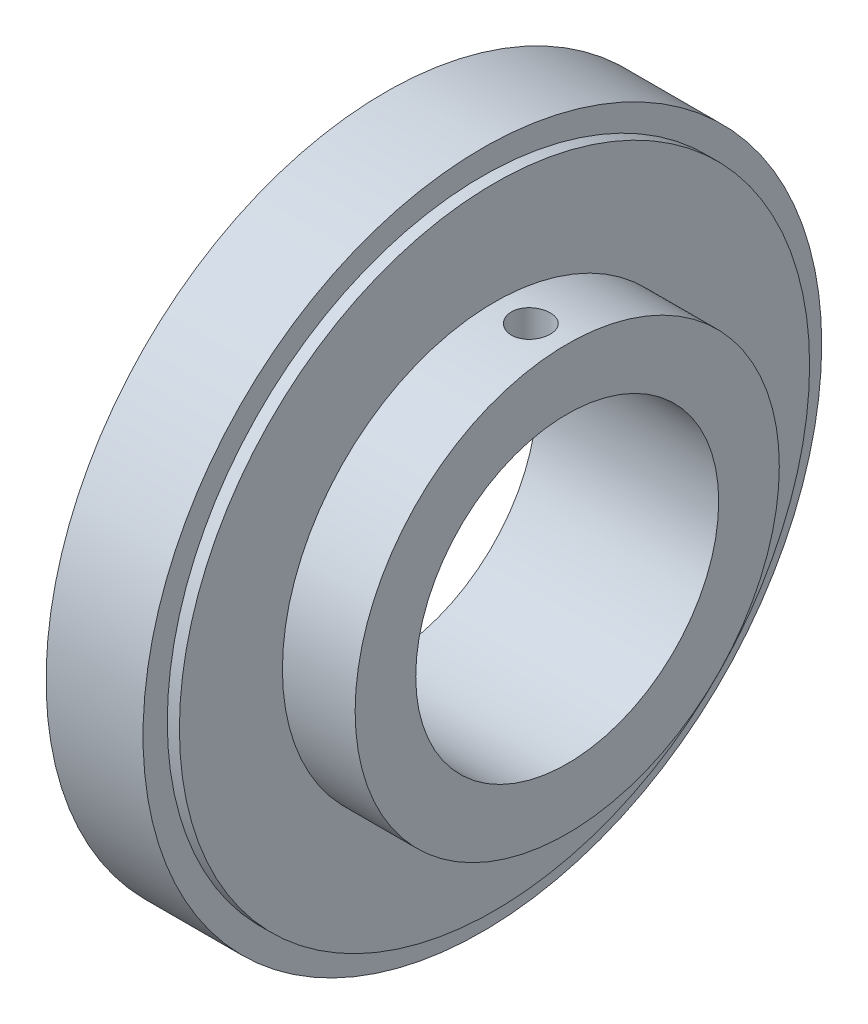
ISO-10303-21;
HEADER;
FILE_DESCRIPTION(('STEP AP214'),'2;1');
FILE_NAME('part.step','',(''),(''),'','','');
FILE_SCHEMA(('AUTOMOTIVE_DESIGN { 1 0 10303 214 1 1 1 1 }'));
ENDSEC;
DATA;
#1=APPLICATION_CONTEXT('core data for automotive mechanical design processes');
#2=APPLICATION_PROTOCOL_DEFINITION('international standard','automotive_design',2000,#1);
#3=PRODUCT_CONTEXT('',#1,'mechanical');
#4=PRODUCT('Part','Part','',(#3));
#5=PRODUCT_RELATED_PRODUCT_CATEGORY('part','',(#4));
#6=PRODUCT_DEFINITION_FORMATION('','',#4);
#7=PRODUCT_DEFINITION_CONTEXT('part definition',#1,'design');
#8=PRODUCT_DEFINITION('design','',#6,#7);
#9=PRODUCT_DEFINITION_SHAPE('','',#8);
#10=(LENGTH_UNIT() NAMED_UNIT(*) SI_UNIT(.MILLI.,.METRE.));
#11=(NAMED_UNIT(*) PLANE_ANGLE_UNIT() SI_UNIT($,.RADIAN.));
#12=(NAMED_UNIT(*) SI_UNIT($,.STERADIAN.) SOLID_ANGLE_UNIT());
#13=UNCERTAINTY_MEASURE_WITH_UNIT(LENGTH_MEASURE(1.E-05),#10,'distance_accuracy_value','');
#14=(GEOMETRIC_REPRESENTATION_CONTEXT(3) GLOBAL_UNCERTAINTY_ASSIGNED_CONTEXT((#13)) GLOBAL_UNIT_ASSIGNED_CONTEXT((#10,
#11,#12)) REPRESENTATION_CONTEXT('',''));
#15=CARTESIAN_POINT('',(0.,0.,0.));
#16=DIRECTION('',(0.,0.,1.));
#17=DIRECTION('',(1.,0.,0.));
#18=AXIS2_PLACEMENT_3D('',#15,#16,#17);
#19=CARTESIAN_POINT('',(-7.00000000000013,28.0000000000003,-3.05311331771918E-13));
#20=DIRECTION('',(1.,0.,0.));
#21=DIRECTION('',(0.,0.,-1.00000000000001));
#22=AXIS2_PLACEMENT_3D('',#19,#20,#21);
#23=PLANE('',#22);
#24=CARTESIAN_POINT('',(-6.99999999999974,0.,0.));
#25=DIRECTION('',(1.,0.,0.));
#26=DIRECTION('',(0.,0.,-1.00000000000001));
#27=AXIS2_PLACEMENT_3D('',#24,#25,#26);
#28=CIRCLE('',#27,28.);
#29=CARTESIAN_POINT('',(-6.99999999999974,0.,-28.0000000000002));
#30=VERTEX_POINT('',#29);
#31=EDGE_CURVE('E54',#30,#30,#28,.T.);
#32=ORIENTED_EDGE('',*,*,#31,.T.);
#33=EDGE_LOOP('',(#32));
#34=FACE_BOUND('',#33,.T.);
#35=CARTESIAN_POINT('',(-6.99999999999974,0.,0.));
#36=DIRECTION('',(1.,0.,0.));
#37=DIRECTION('',(0.,0.,-1.00000000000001));
#38=AXIS2_PLACEMENT_3D('',#35,#36,#37);
#39=CIRCLE('',#38,17.5);
#40=CARTESIAN_POINT('',(-6.99999999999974,0.,-17.5000000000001));
#41=VERTEX_POINT('',#40);
#42=EDGE_CURVE('E11',#41,#41,#39,.T.);
#43=ORIENTED_EDGE('',*,*,#42,.F.);
#44=EDGE_LOOP('',(#43));
#45=FACE_BOUND('',#44,.T.);
#46=ADVANCED_FACE('F40',(#34,#45),#23,.T.);
#47=CARTESIAN_POINT('',(-1.52655665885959E-13,0.,0.));
#48=DIRECTION('',(1.,0.,0.));
#49=DIRECTION('',(0.,0.,-1.00000000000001));
#50=AXIS2_PLACEMENT_3D('',#47,#48,#49);
#51=CYLINDRICAL_SURFACE('',#50,17.5);
#52=ORIENTED_EDGE('',*,*,#42,.T.);
#53=EDGE_LOOP('',(#52));
#54=FACE_BOUND('',#53,.T.);
#55=CARTESIAN_POINT('',(-15.,0.,0.));
#56=DIRECTION('',(1.,0.,0.));
#57=DIRECTION('',(0.,0.,-1.00000000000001));
#58=AXIS2_PLACEMENT_3D('',#55,#56,#57);
#59=CIRCLE('',#58,17.5);
#60=CARTESIAN_POINT('',(-15.,0.,-17.5000000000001));
#61=VERTEX_POINT('',#60);
#62=EDGE_CURVE('E46',#61,#61,#59,.T.);
#63=ORIENTED_EDGE('',*,*,#62,.F.);
#64=EDGE_LOOP('',(#63));
#65=FACE_BOUND('',#64,.T.);
#66=ADVANCED_FACE('F70',(#54,#65),#51,.F.);
#67=CARTESIAN_POINT('',(-15.0000000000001,17.5,0.));
#68=DIRECTION('',(-1.,0.,0.));
#69=DIRECTION('',(0.,0.,1.00000000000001));
#70=AXIS2_PLACEMENT_3D('',#67,#68,#69);
#71=PLANE('',#70);
#72=ORIENTED_EDGE('',*,*,#62,.T.);
#73=EDGE_LOOP('',(#72));
#74=FACE_BOUND('',#73,.T.);
#75=CARTESIAN_POINT('',(-15.,0.,0.));
#76=DIRECTION('',(1.,0.,0.));
#77=DIRECTION('',(0.,0.,-1.00000000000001));
#78=AXIS2_PLACEMENT_3D('',#75,#76,#77);
#79=CIRCLE('',#78,28.);
#80=CARTESIAN_POINT('',(-15.,0.,-28.0000000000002));
#81=VERTEX_POINT('',#80);
#82=EDGE_CURVE('E50',#81,#81,#79,.T.);
#83=ORIENTED_EDGE('',*,*,#82,.F.);
#84=EDGE_LOOP('',(#83));
#85=FACE_BOUND('',#84,.T.);
#86=ADVANCED_FACE('F64',(#74,#85),#71,.T.);
#87=CARTESIAN_POINT('',(-1.52655665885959E-13,0.,0.));
#88=DIRECTION('',(1.,0.,0.));
#89=DIRECTION('',(0.,0.,-1.00000000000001));
#90=AXIS2_PLACEMENT_3D('',#87,#88,#89);
#91=CYLINDRICAL_SURFACE('',#90,28.);
#92=ORIENTED_EDGE('',*,*,#82,.T.);
#93=EDGE_LOOP('',(#92));
#94=FACE_BOUND('',#93,.T.);
#95=ORIENTED_EDGE('',*,*,#31,.F.);
#96=EDGE_LOOP('',(#95));
#97=FACE_BOUND('',#96,.T.);
#98=ADVANCED_FACE('F62',(#94,#97),#91,.T.);
#99=CLOSED_SHELL('',(#46,#66,#86,#98));
#100=MANIFOLD_SOLID_BREP('B2',#99);
#101=CARTESIAN_POINT('',(-1.52655665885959E-13,0.,0.));
#102=DIRECTION('',(1.,0.,0.));
#103=DIRECTION('',(0.,0.,-1.00000000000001));
#104=AXIS2_PLACEMENT_3D('',#101,#102,#103);
#105=CYLINDRICAL_SURFACE('',#104,12.5);
#106=CARTESIAN_POINT('',(-4.59999999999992,12.4999999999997,1.66533453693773E-13));
#107=CARTESIAN_POINT('',(-4.59999620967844,12.4999987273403,-0.0894802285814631));
#108=CARTESIAN_POINT('',(-4.59246839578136,12.4990290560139,-0.179015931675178));
#109=CARTESIAN_POINT('',(-4.56255800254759,12.4952541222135,-0.355594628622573));
#110=CARTESIAN_POINT('',(-4.54016002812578,12.4924469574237,-0.442634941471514));
#111=CARTESIAN_POINT('',(-4.4811810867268,12.4853131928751,-0.61164105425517));
#112=CARTESIAN_POINT('',(-4.44460979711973,12.4809876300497,-0.693610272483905));
#113=CARTESIAN_POINT('',(-4.3583438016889,12.4712978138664,-0.850232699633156));
#114=CARTESIAN_POINT('',(-4.30865129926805,12.4659337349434,-0.924887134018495));
#115=CARTESIAN_POINT('',(-4.19724751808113,12.4547309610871,-1.0652061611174));
#116=CARTESIAN_POINT('',(-4.13547572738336,12.4488899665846,-1.1308225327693));
#117=CARTESIAN_POINT('',(-4.00179681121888,12.4374101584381,-1.25078744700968));
#118=CARTESIAN_POINT('',(-3.92988916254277,12.4317713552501,-1.3051354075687));
#119=CARTESIAN_POINT('',(-3.77766511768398,12.421311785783,-1.40120131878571));
#120=CARTESIAN_POINT('',(-3.69731988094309,12.4164939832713,-1.4428739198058));
#121=CARTESIAN_POINT('',(-3.53069940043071,12.4082523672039,-1.51211654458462));
#122=CARTESIAN_POINT('',(-3.44442439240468,12.4048284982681,-1.53968712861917));
#123=CARTESIAN_POINT('',(-3.26889469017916,12.3997844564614,-1.57979618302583));
#124=CARTESIAN_POINT('',(-3.17965891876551,12.3981545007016,-1.59241621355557));
#125=CARTESIAN_POINT('',(-3.00032233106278,12.3968529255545,-1.60251833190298));
#126=CARTESIAN_POINT('',(-2.91022155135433,12.3971812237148,-1.60000105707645));
#127=CARTESIAN_POINT('',(-2.73228183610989,12.3997501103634,-1.57996693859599));
#128=CARTESIAN_POINT('',(-2.64443258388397,12.4019792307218,-1.5625400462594));
#129=CARTESIAN_POINT('',(-2.47291569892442,12.4080807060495,-1.51332177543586));
#130=CARTESIAN_POINT('',(-2.38924815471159,12.411953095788,-1.48153009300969));
#131=CARTESIAN_POINT('',(-2.22819089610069,12.4209177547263,-1.40438835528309));
#132=CARTESIAN_POINT('',(-2.15082005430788,12.4260135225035,-1.35899932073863));
#133=CARTESIAN_POINT('',(-2.00475931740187,12.4368480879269,-1.25597917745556));
#134=CARTESIAN_POINT('',(-1.93606983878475,12.4425869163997,-1.19834748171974));
#135=CARTESIAN_POINT('',(-1.8087996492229,12.4541119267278,-1.07197998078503));
#136=CARTESIAN_POINT('',(-1.75029587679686,12.4598981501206,-1.00316666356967));
#137=CARTESIAN_POINT('',(-1.64565723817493,12.4708270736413,-0.856655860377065));
#138=CARTESIAN_POINT('',(-1.59952240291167,12.4759697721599,-0.778958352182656));
#139=CARTESIAN_POINT('',(-1.52093075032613,12.4850356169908,-0.616824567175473));
#140=CARTESIAN_POINT('',(-1.48847887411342,12.4889583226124,-0.532385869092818));
#141=CARTESIAN_POINT('',(-1.438236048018,12.4951382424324,-0.359196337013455));
#142=CARTESIAN_POINT('',(-1.42044437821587,12.4973955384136,-0.270445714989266));
#143=CARTESIAN_POINT('',(-1.40012700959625,12.4999796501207,-0.0918167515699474));
#144=CARTESIAN_POINT('',(-1.39749534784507,12.5003198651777,-0.00195064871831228));
#145=CARTESIAN_POINT('',(-1.40729288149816,12.4990676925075,0.176941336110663));
#146=CARTESIAN_POINT('',(-1.41972174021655,12.4974753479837,0.265967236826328));
#147=CARTESIAN_POINT('',(-1.45919946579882,12.492545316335,0.440338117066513));
#148=CARTESIAN_POINT('',(-1.48619768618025,12.4892136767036,0.525694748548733));
#149=CARTESIAN_POINT('',(-1.55399501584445,12.4811779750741,0.690668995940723));
#150=CARTESIAN_POINT('',(-1.59479461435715,12.4764738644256,0.770286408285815));
#151=CARTESIAN_POINT('',(-1.689292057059,12.4661840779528,0.921994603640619));
#152=CARTESIAN_POINT('',(-1.74305829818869,12.4605937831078,0.994042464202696));
#153=CARTESIAN_POINT('',(-1.8618662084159,12.4491711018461,1.12812939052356));
#154=CARTESIAN_POINT('',(-1.92690834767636,12.4433387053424,1.19016803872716));
#155=CARTESIAN_POINT('',(-2.06688907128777,12.4320476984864,1.30285251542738));
#156=CARTESIAN_POINT('',(-2.14188449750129,12.4265915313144,1.35342801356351));
#157=CARTESIAN_POINT('',(-2.29936771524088,12.4167112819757,1.44126433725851));
#158=CARTESIAN_POINT('',(-2.38185535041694,12.4122871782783,1.47852544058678));
#159=CARTESIAN_POINT('',(-2.55175644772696,12.4049887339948,1.53856194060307));
#160=CARTESIAN_POINT('',(-2.63915581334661,12.4021101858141,1.56137669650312));
#161=CARTESIAN_POINT('',(-2.81658438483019,12.398216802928,1.59199947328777));
#162=CARTESIAN_POINT('',(-2.90661346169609,12.3972018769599,1.59980822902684));
#163=CARTESIAN_POINT('',(-3.08604603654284,12.3971533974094,1.60018341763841));
#164=CARTESIAN_POINT('',(-3.17544931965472,12.3981054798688,1.59286034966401));
#165=CARTESIAN_POINT('',(-3.35174304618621,12.4018528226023,1.56341406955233));
#166=CARTESIAN_POINT('',(-3.4386334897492,12.4046480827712,1.54129085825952));
#167=CARTESIAN_POINT('',(-3.60741869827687,12.4117623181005,1.48290735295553));
#168=CARTESIAN_POINT('',(-3.6893154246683,12.4160806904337,1.44665265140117));
#169=CARTESIAN_POINT('',(-3.8458807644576,12.425755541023,1.36104616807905));
#170=CARTESIAN_POINT('',(-3.92054926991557,12.4311120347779,1.31169419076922));
#171=CARTESIAN_POINT('',(-4.06110311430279,12.4423064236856,1.20088500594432));
#172=CARTESIAN_POINT('',(-4.12692331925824,12.4481474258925,1.13934548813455));
#173=CARTESIAN_POINT('',(-4.2473446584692,12.4596254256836,1.00608024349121));
#174=CARTESIAN_POINT('',(-4.30194314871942,12.4652623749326,0.934352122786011));
#175=CARTESIAN_POINT('',(-4.39855763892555,12.4757220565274,0.782416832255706));
#176=CARTESIAN_POINT('',(-4.44052264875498,12.4805414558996,0.702177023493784));
#177=CARTESIAN_POINT('',(-4.51032195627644,12.4887894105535,0.53577133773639));
#178=CARTESIAN_POINT('',(-4.53817152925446,12.4922194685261,0.449611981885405));
#179=CARTESIAN_POINT('',(-4.57232134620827,12.4964802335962,0.302510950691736));
#180=CARTESIAN_POINT('',(-4.58268582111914,12.4977936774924,0.242494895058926));
#181=CARTESIAN_POINT('',(-4.59652640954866,12.4995539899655,0.121661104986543));
#182=CARTESIAN_POINT('',(-4.60000257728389,12.500000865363,0.0608433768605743));
#183=CARTESIAN_POINT('',(-4.59999999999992,12.4999999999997,1.66533453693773E-13));
#184=B_SPLINE_CURVE_WITH_KNOTS('',3,(#106,#107,#108,#109,#110,#111,#112,#113,#114,#115,#116,
#117,#118,#119,#120,#121,#122,#123,#124,#125,#126,#127,#128,#129,#130,#131,#132,#133,#134,#135,
#136,#137,#138,#139,#140,#141,#142,#143,#144,#145,#146,#147,#148,#149,#150,#151,#152,#153,#154,
#155,#156,#157,#158,#159,#160,#161,#162,#163,#164,#165,#166,#167,#168,#169,#170,#171,#172,#173,
#174,#175,#176,#177,#178,#179,#180,#181,#182,#183),.UNSPECIFIED.,.T.,.F.,(4,2,2,2,2,2,2,2,2,2,2,
2,2,2,2,2,2,2,2,2,2,2,2,2,2,2,2,2,2,2,2,2,2,2,2,2,2,2,4),(0.,0.268218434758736,0.53671499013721,
0.805028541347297,1.073297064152,1.34294561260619,1.61260808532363,1.88322429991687,
2.15382976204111,2.42295208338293,2.69206307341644,2.95956184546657,3.22706627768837,
3.49534501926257,3.76363662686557,4.03387430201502,4.30411265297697,4.57444850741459,
4.84477108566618,5.11320189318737,5.38162669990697,5.64912435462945,5.91663149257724,
6.18558179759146,6.45454331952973,6.72511284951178,6.99567673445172,7.26550025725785,
7.53531056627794,7.80315756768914,8.07100455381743,8.33874564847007,8.60649074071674,
8.87610985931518,9.14579243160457,9.41654931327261,9.68701256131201,9.86939300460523,
10.0517720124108),.UNSPECIFIED.);
#185=CARTESIAN_POINT('',(-4.59999999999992,12.4999999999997,1.66533453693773E-13));
#186=VERTEX_POINT('',#185);
#187=EDGE_CURVE('E137',#186,#186,#184,.T.);
#188=ORIENTED_EDGE('',*,*,#187,.F.);
#189=EDGE_LOOP('',(#188));
#190=FACE_BOUND('',#189,.T.);
#191=CARTESIAN_POINT('',(-1.52655665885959E-13,0.,0.));
#192=DIRECTION('',(1.,0.,0.));
#193=DIRECTION('',(0.,0.,-1.00000000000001));
#194=AXIS2_PLACEMENT_3D('',#191,#192,#193);
#195=CIRCLE('',#194,12.5);
#196=CARTESIAN_POINT('',(-1.52664136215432E-13,0.,-12.5000000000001));
#197=VERTEX_POINT('',#196);
#198=EDGE_CURVE('E39',#197,#197,#195,.T.);
#199=ORIENTED_EDGE('',*,*,#198,.T.);
#200=EDGE_LOOP('',(#199));
#201=FACE_BOUND('',#200,.T.);
#202=CARTESIAN_POINT('',(-15.,0.,0.));
#203=DIRECTION('',(1.,0.,0.));
#204=DIRECTION('',(0.,0.,-1.00000000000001));
#205=AXIS2_PLACEMENT_3D('',#202,#203,#204);
#206=CIRCLE('',#205,12.5);
#207=CARTESIAN_POINT('',(-15.,0.,-12.5000000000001));
#208=VERTEX_POINT('',#207);
#209=EDGE_CURVE('E134',#208,#208,#206,.T.);
#210=ORIENTED_EDGE('',*,*,#209,.F.);
#211=EDGE_LOOP('',(#210));
#212=FACE_BOUND('',#211,.T.);
#213=ADVANCED_FACE('F101',(#190,#201,#212),#105,.F.);
#214=CARTESIAN_POINT('',(3.19189119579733E-13,12.5,0.));
#215=DIRECTION('',(1.,0.,0.));
#216=DIRECTION('',(0.,0.,-1.00000000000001));
#217=AXIS2_PLACEMENT_3D('',#214,#215,#216);
#218=PLANE('',#217);
#219=CARTESIAN_POINT('',(-1.52655665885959E-13,0.,0.));
#220=DIRECTION('',(1.,0.,0.));
#221=DIRECTION('',(0.,0.,-1.00000000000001));
#222=AXIS2_PLACEMENT_3D('',#219,#220,#221);
#223=CIRCLE('',#222,17.5);
#224=CARTESIAN_POINT('',(-1.52667524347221E-13,0.,-17.5000000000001));
#225=VERTEX_POINT('',#224);
#226=EDGE_CURVE('E113',#225,#225,#223,.T.);
#227=ORIENTED_EDGE('',*,*,#226,.T.);
#228=EDGE_LOOP('',(#227));
#229=FACE_BOUND('',#228,.T.);
#230=ORIENTED_EDGE('',*,*,#198,.F.);
#231=EDGE_LOOP('',(#230));
#232=FACE_BOUND('',#231,.T.);
#233=ADVANCED_FACE('F169',(#229,#232),#218,.T.);
#234=CARTESIAN_POINT('',(-1.52655665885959E-13,0.,0.));
#235=DIRECTION('',(1.,0.,0.));
#236=DIRECTION('',(0.,0.,-1.00000000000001));
#237=AXIS2_PLACEMENT_3D('',#234,#235,#236);
#238=CYLINDRICAL_SURFACE('',#237,17.5);
#239=CARTESIAN_POINT('',(-4.59999999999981,17.5,0.));
#240=CARTESIAN_POINT('',(-4.5999960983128,17.4999990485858,0.0896718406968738));
#241=CARTESIAN_POINT('',(-4.59243615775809,17.4993034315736,0.179403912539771));
#242=CARTESIAN_POINT('',(-4.56239068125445,17.4965953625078,0.356383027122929));
#243=CARTESIAN_POINT('',(-4.53988845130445,17.4945814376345,0.443627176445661));
#244=CARTESIAN_POINT('',(-4.48061658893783,17.4894642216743,0.61304179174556));
#245=CARTESIAN_POINT('',(-4.44385528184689,17.4863615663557,0.695215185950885));
#246=CARTESIAN_POINT('',(-4.35712427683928,17.4794143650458,0.852206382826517));
#247=CARTESIAN_POINT('',(-4.30715731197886,17.4755699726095,0.927025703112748));
#248=CARTESIAN_POINT('',(-4.1952701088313,17.4675572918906,1.06743087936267));
#249=CARTESIAN_POINT('',(-4.13331801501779,17.4633881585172,1.13299130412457));
#250=CARTESIAN_POINT('',(-3.99928680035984,17.4552029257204,1.25279927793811));
#251=CARTESIAN_POINT('',(-3.92720722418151,17.451186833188,1.30704631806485));
#252=CARTESIAN_POINT('',(-3.77481049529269,17.4437535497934,1.40277576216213));
#253=CARTESIAN_POINT('',(-3.69447903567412,17.4403374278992,1.44423548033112));
#254=CARTESIAN_POINT('',(-3.52795832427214,17.4345009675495,1.51306851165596));
#255=CARTESIAN_POINT('',(-3.44176919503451,17.4320806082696,1.54044211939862));
#256=CARTESIAN_POINT('',(-3.26623691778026,17.4285170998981,1.58025129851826));
#257=CARTESIAN_POINT('',(-3.17690332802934,17.4273703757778,1.59272869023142));
#258=CARTESIAN_POINT('',(-2.99740308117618,17.4264727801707,1.60252048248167));
#259=CARTESIAN_POINT('',(-2.90723644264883,17.4267218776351,1.59983522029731));
#260=CARTESIAN_POINT('',(-2.72891697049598,17.428584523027,1.57941244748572));
#261=CARTESIAN_POINT('',(-2.6407588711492,17.4301939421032,1.56172048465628));
#262=CARTESIAN_POINT('',(-2.46866862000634,17.4345894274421,1.51185733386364));
#263=CARTESIAN_POINT('',(-2.38473651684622,17.4373755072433,1.47968597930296));
#264=CARTESIAN_POINT('',(-2.22333621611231,17.4438151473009,1.4017266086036));
#265=CARTESIAN_POINT('',(-2.14587789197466,17.4474700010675,1.35591826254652));
#266=CARTESIAN_POINT('',(-1.99973191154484,17.4552342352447,1.25199987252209));
#267=CARTESIAN_POINT('',(-1.93104446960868,17.4593436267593,1.19388952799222));
#268=CARTESIAN_POINT('',(-1.80412527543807,17.467572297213,1.06676171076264));
#269=CARTESIAN_POINT('',(-1.74593293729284,17.4716915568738,0.997704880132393));
#270=CARTESIAN_POINT('',(-1.64196090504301,17.4794614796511,0.850781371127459));
#271=CARTESIAN_POINT('',(-1.59618122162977,17.4831121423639,0.772914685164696));
#272=CARTESIAN_POINT('',(-1.51833606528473,17.4895344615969,0.610555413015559));
#273=CARTESIAN_POINT('',(-1.48627245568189,17.4923059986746,0.526061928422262));
#274=CARTESIAN_POINT('',(-1.43679780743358,17.4966564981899,0.352859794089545));
#275=CARTESIAN_POINT('',(-1.41938640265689,17.4982354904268,0.264151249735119));
#276=CARTESIAN_POINT('',(-1.39976009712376,17.5000191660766,0.0853785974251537));
#277=CARTESIAN_POINT('',(-1.397490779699,17.5002287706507,-0.00467948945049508));
#278=CARTESIAN_POINT('',(-1.40807034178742,17.4992632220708,-0.183894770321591));
#279=CARTESIAN_POINT('',(-1.42091905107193,17.498088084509,-0.273051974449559));
#280=CARTESIAN_POINT('',(-1.46132481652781,17.4944883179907,-0.447778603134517));
#281=CARTESIAN_POINT('',(-1.48885653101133,17.4920658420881,-0.5333539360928));
#282=CARTESIAN_POINT('',(-1.55782082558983,17.4862433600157,-0.698670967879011));
#283=CARTESIAN_POINT('',(-1.59925366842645,17.4828433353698,-0.778412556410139));
#284=CARTESIAN_POINT('',(-1.69498001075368,17.4754342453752,-0.930045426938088));
#285=CARTESIAN_POINT('',(-1.74930942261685,17.4714234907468,-1.00191395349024));
#286=CARTESIAN_POINT('',(-1.86923499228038,17.463248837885,-1.13553061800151));
#287=CARTESIAN_POINT('',(-1.93483138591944,17.4590849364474,-1.19727854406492));
#288=CARTESIAN_POINT('',(-2.07566562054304,17.4510586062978,-1.30908892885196));
#289=CARTESIAN_POINT('',(-2.15093179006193,17.447197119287,-1.35911578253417));
#290=CARTESIAN_POINT('',(-2.30882863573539,17.4402266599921,-1.44581952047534));
#291=CARTESIAN_POINT('',(-2.39145922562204,17.4371176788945,-1.48249656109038));
#292=CARTESIAN_POINT('',(-2.56161509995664,17.4320098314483,-1.54139937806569));
#293=CARTESIAN_POINT('',(-2.64913288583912,17.4300093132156,-1.56364666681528));
#294=CARTESIAN_POINT('',(-2.8266808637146,17.4273395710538,-1.59312839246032));
#295=CARTESIAN_POINT('',(-2.91671099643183,17.4266703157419,-1.6003631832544));
#296=CARTESIAN_POINT('',(-3.09637418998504,17.4267394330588,-1.59961008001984));
#297=CARTESIAN_POINT('',(-3.18600749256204,17.4274726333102,-1.59167812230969));
#298=CARTESIAN_POINT('',(-3.36266291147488,17.430253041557,-1.56093361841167));
#299=CARTESIAN_POINT('',(-3.44968502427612,17.4323002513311,-1.53812105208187));
#300=CARTESIAN_POINT('',(-3.61864954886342,17.4374766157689,-1.47827766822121));
#301=CARTESIAN_POINT('',(-3.70059242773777,17.4406056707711,-1.44124816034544));
#302=CARTESIAN_POINT('',(-3.85710815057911,17.4475933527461,-1.35402801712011));
#303=CARTESIAN_POINT('',(-3.93168107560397,17.4514519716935,-1.30383752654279));
#304=CARTESIAN_POINT('',(-4.0716265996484,17.4594810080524,-1.19150983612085));
#305=CARTESIAN_POINT('',(-4.13696576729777,17.4636524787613,-1.12933106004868));
#306=CARTESIAN_POINT('',(-4.2563092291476,17.4718275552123,-0.994871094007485));
#307=CARTESIAN_POINT('',(-4.31031079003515,17.4758311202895,-0.922587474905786));
#308=CARTESIAN_POINT('',(-4.4055342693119,17.4832279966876,-0.769803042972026));
#309=CARTESIAN_POINT('',(-4.44672830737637,17.4866199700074,-0.689284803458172));
#310=CARTESIAN_POINT('',(-4.51495802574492,17.4923963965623,-0.522496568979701));
#311=CARTESIAN_POINT('',(-4.54200983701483,17.4947819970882,-0.436233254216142));
#312=CARTESIAN_POINT('',(-4.57436422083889,17.4976704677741,-0.291225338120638));
#313=CARTESIAN_POINT('',(-4.5839646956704,17.498540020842,-0.233410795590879));
#314=CARTESIAN_POINT('',(-4.59678384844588,17.4997050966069,-0.117072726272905));
#315=CARTESIAN_POINT('',(-4.60000254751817,17.5000006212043,-0.0585492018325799));
#316=CARTESIAN_POINT('',(-4.59999999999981,17.5,0.));
#317=B_SPLINE_CURVE_WITH_KNOTS('',3,(#239,#240,#241,#242,#243,#244,#245,#246,#247,#248,#249,
#250,#251,#252,#253,#254,#255,#256,#257,#258,#259,#260,#261,#262,#263,#264,#265,#266,#267,#268,
#269,#270,#271,#272,#273,#274,#275,#276,#277,#278,#279,#280,#281,#282,#283,#284,#285,#286,#287,
#288,#289,#290,#291,#292,#293,#294,#295,#296,#297,#298,#299,#300,#301,#302,#303,#304,#305,#306,
#307,#308,#309,#310,#311,#312,#313,#314,#315,#316),.UNSPECIFIED.,.T.,.F.,(4,2,2,2,2,2,2,2,2,2,2,
2,2,2,2,2,2,2,2,2,2,2,2,2,2,2,2,2,2,2,2,2,2,2,2,2,2,2,4),(0.,0.268801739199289,
0.537904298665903,0.806849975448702,1.07574003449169,1.3453548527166,1.61498179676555,
1.88508436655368,2.15518128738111,2.42451812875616,2.69384897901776,2.96236527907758,
3.23088466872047,3.49980638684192,3.76873467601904,4.03865279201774,4.3085711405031,
4.57852614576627,4.84847440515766,5.11745201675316,5.38642659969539,5.65493844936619,
5.9234553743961,6.19272898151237,6.46200822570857,6.73209514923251,7.00217890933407,
7.27185908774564,7.54153290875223,7.8102140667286,8.07889558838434,8.34755236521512,
8.61620618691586,8.8858090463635,9.15547682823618,9.42572759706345,9.69566943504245,
9.87117803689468,10.0466860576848),.UNSPECIFIED.);
#318=CARTESIAN_POINT('',(-4.59999999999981,17.5,0.));
#319=VERTEX_POINT('',#318);
#320=EDGE_CURVE('E105',#319,#319,#317,.T.);
#321=ORIENTED_EDGE('',*,*,#320,.F.);
#322=EDGE_LOOP('',(#321));
#323=FACE_BOUND('',#322,.T.);
#324=CARTESIAN_POINT('',(-5.99999999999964,1.11022302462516E-13,0.));
#325=DIRECTION('',(1.,0.,0.));
#326=DIRECTION('',(0.,0.,-1.00000000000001));
#327=AXIS2_PLACEMENT_3D('',#324,#325,#326);
#328=CIRCLE('',#327,17.5);
#329=CARTESIAN_POINT('',(-5.99999999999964,1.04200034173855E-13,-17.5000000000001));
#330=VERTEX_POINT('',#329);
#331=EDGE_CURVE('E117',#330,#330,#328,.T.);
#332=ORIENTED_EDGE('',*,*,#331,.T.);
#333=EDGE_LOOP('',(#332));
#334=FACE_BOUND('',#333,.T.);
#335=ORIENTED_EDGE('',*,*,#226,.F.);
#336=EDGE_LOOP('',(#335));
#337=FACE_BOUND('',#336,.T.);
#338=ADVANCED_FACE('F165',(#323,#334,#337),#238,.T.);
#339=CARTESIAN_POINT('',(-5.99999999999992,17.5000000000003,-2.4980018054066E-13));
#340=DIRECTION('',(1.,0.,0.));
#341=DIRECTION('',(0.,0.,-1.00000000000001));
#342=AXIS2_PLACEMENT_3D('',#339,#340,#341);
#343=PLANE('',#342);
#344=CARTESIAN_POINT('',(-5.99999999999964,1.11022302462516E-13,0.));
#345=DIRECTION('',(1.,0.,0.));
#346=DIRECTION('',(0.,0.,-1.00000000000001));
#347=AXIS2_PLACEMENT_3D('',#344,#345,#346);
#348=CIRCLE('',#347,26.);
#349=CARTESIAN_POINT('',(-5.99999999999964,1.00886361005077E-13,-26.0000000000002));
#350=VERTEX_POINT('',#349);
#351=EDGE_CURVE('E122',#350,#350,#348,.T.);
#352=ORIENTED_EDGE('',*,*,#351,.T.);
#353=EDGE_LOOP('',(#352));
#354=FACE_BOUND('',#353,.T.);
#355=ORIENTED_EDGE('',*,*,#331,.F.);
#356=EDGE_LOOP('',(#355));
#357=FACE_BOUND('',#356,.T.);
#358=ADVANCED_FACE('F162',(#354,#357),#343,.T.);
#359=CARTESIAN_POINT('',(-1.52655665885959E-13,0.,0.));
#360=DIRECTION('',(1.,0.,0.));
#361=DIRECTION('',(0.,0.,-1.00000000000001));
#362=AXIS2_PLACEMENT_3D('',#359,#360,#361);
#363=CYLINDRICAL_SURFACE('',#362,26.);
#364=CARTESIAN_POINT('',(-6.99999999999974,0.,0.));
#365=DIRECTION('',(1.,0.,0.));
#366=DIRECTION('',(0.,0.,-1.00000000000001));
#367=AXIS2_PLACEMENT_3D('',#364,#365,#366);
#368=CIRCLE('',#367,26.);
#369=CARTESIAN_POINT('',(-6.99999999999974,0.,-26.0000000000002));
#370=VERTEX_POINT('',#369);
#371=EDGE_CURVE('E125',#370,#370,#368,.T.);
#372=ORIENTED_EDGE('',*,*,#371,.T.);
#373=EDGE_LOOP('',(#372));
#374=FACE_BOUND('',#373,.T.);
#375=ORIENTED_EDGE('',*,*,#351,.F.);
#376=EDGE_LOOP('',(#375));
#377=FACE_BOUND('',#376,.T.);
#378=ADVANCED_FACE('F158',(#374,#377),#363,.T.);
#379=CARTESIAN_POINT('',(-6.99999999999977,26.0000000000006,0.));
#380=DIRECTION('',(-1.,0.,0.));
#381=DIRECTION('',(0.,0.,1.00000000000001));
#382=AXIS2_PLACEMENT_3D('',#379,#380,#381);
#383=PLANE('',#382);
#384=CARTESIAN_POINT('',(-6.99999999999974,0.,0.));
#385=DIRECTION('',(1.,0.,0.));
#386=DIRECTION('',(0.,0.,-1.00000000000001));
#387=AXIS2_PLACEMENT_3D('',#384,#385,#386);
#388=CIRCLE('',#387,17.5);
#389=CARTESIAN_POINT('',(-6.99999999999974,0.,-17.5000000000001));
#390=VERTEX_POINT('',#389);
#391=EDGE_CURVE('E128',#390,#390,#388,.T.);
#392=ORIENTED_EDGE('',*,*,#391,.T.);
#393=EDGE_LOOP('',(#392));
#394=FACE_BOUND('',#393,.T.);
#395=ORIENTED_EDGE('',*,*,#371,.F.);
#396=EDGE_LOOP('',(#395));
#397=FACE_BOUND('',#396,.T.);
#398=ADVANCED_FACE('F154',(#394,#397),#383,.T.);
#399=CARTESIAN_POINT('',(-1.52655665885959E-13,0.,0.));
#400=DIRECTION('',(1.,0.,0.));
#401=DIRECTION('',(0.,0.,-1.00000000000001));
#402=AXIS2_PLACEMENT_3D('',#399,#400,#401);
#403=CYLINDRICAL_SURFACE('',#402,17.5);
#404=CARTESIAN_POINT('',(-15.,0.,0.));
#405=DIRECTION('',(1.,0.,0.));
#406=DIRECTION('',(0.,0.,-1.00000000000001));
#407=AXIS2_PLACEMENT_3D('',#404,#405,#406);
#408=CIRCLE('',#407,17.5);
#409=CARTESIAN_POINT('',(-15.,0.,-17.5000000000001));
#410=VERTEX_POINT('',#409);
#411=EDGE_CURVE('E131',#410,#410,#408,.T.);
#412=ORIENTED_EDGE('',*,*,#411,.T.);
#413=EDGE_LOOP('',(#412));
#414=FACE_BOUND('',#413,.T.);
#415=ORIENTED_EDGE('',*,*,#391,.F.);
#416=EDGE_LOOP('',(#415));
#417=FACE_BOUND('',#416,.T.);
#418=ADVANCED_FACE('F150',(#414,#417),#403,.T.);
#419=CARTESIAN_POINT('',(-15.0000000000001,17.5,0.));
#420=DIRECTION('',(-1.,0.,0.));
#421=DIRECTION('',(0.,0.,1.00000000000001));
#422=AXIS2_PLACEMENT_3D('',#419,#420,#421);
#423=PLANE('',#422);
#424=ORIENTED_EDGE('',*,*,#209,.T.);
#425=EDGE_LOOP('',(#424));
#426=FACE_BOUND('',#425,.T.);
#427=ORIENTED_EDGE('',*,*,#411,.F.);
#428=EDGE_LOOP('',(#427));
#429=FACE_BOUND('',#428,.T.);
#430=ADVANCED_FACE('F145',(#426,#429),#423,.T.);
#431=CARTESIAN_POINT('',(-2.99999999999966,20.5398213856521,0.));
#432=DIRECTION('',(0.,1.,0.));
#433=DIRECTION('',(-1.,0.,0.));
#434=AXIS2_PLACEMENT_3D('',#431,#432,#433);
#435=CYLINDRICAL_SURFACE('',#434,1.6);
#436=ORIENTED_EDGE('',*,*,#187,.T.);
#437=EDGE_LOOP('',(#436));
#438=FACE_BOUND('',#437,.T.);
#439=ORIENTED_EDGE('',*,*,#320,.T.);
#440=EDGE_LOOP('',(#439));
#441=FACE_BOUND('',#440,.T.);
#442=ADVANCED_FACE('F141',(#438,#441),#435,.F.);
#443=CLOSED_SHELL('',(#213,#233,#338,#358,#378,#398,#418,#430,#442));
#444=MANIFOLD_SOLID_BREP('B6',#443);
#445=ADVANCED_BREP_SHAPE_REPRESENTATION('',(#18,#100,#444),#14);
#446=SHAPE_DEFINITION_REPRESENTATION(#9,#445);
ENDSEC;
END-ISO-10303-21;
